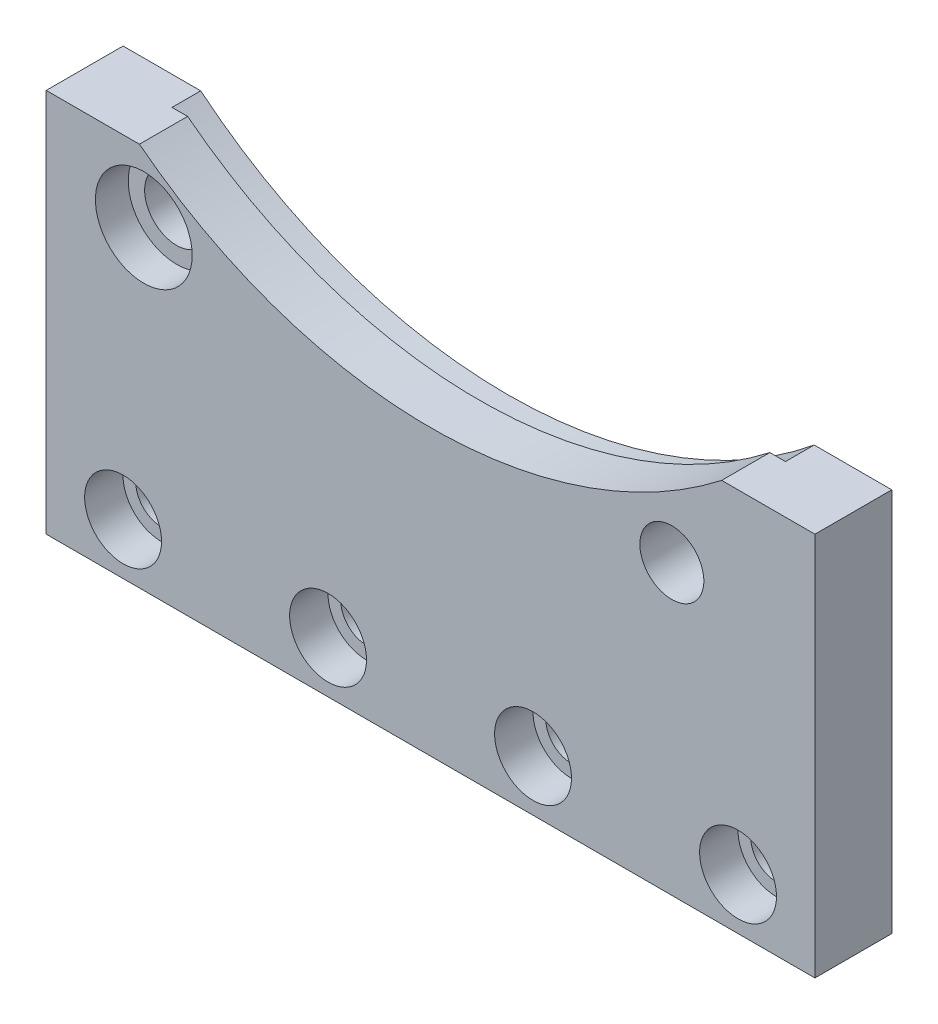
ISO-10303-21;
HEADER;
FILE_DESCRIPTION(('STEP AP214'),'2;1');
FILE_NAME('part.step','',(''),(''),'','','');
FILE_SCHEMA(('AUTOMOTIVE_DESIGN { 1 0 10303 214 1 1 1 1 }'));
ENDSEC;
DATA;
#1=APPLICATION_CONTEXT('core data for automotive mechanical design processes');
#2=APPLICATION_PROTOCOL_DEFINITION('international standard','automotive_design',2000,#1);
#3=PRODUCT_CONTEXT('',#1,'mechanical');
#4=PRODUCT('Part','Part','',(#3));
#5=PRODUCT_RELATED_PRODUCT_CATEGORY('part','',(#4));
#6=PRODUCT_DEFINITION_FORMATION('','',#4);
#7=PRODUCT_DEFINITION_CONTEXT('part definition',#1,'design');
#8=PRODUCT_DEFINITION('design','',#6,#7);
#9=PRODUCT_DEFINITION_SHAPE('','',#8);
#10=(LENGTH_UNIT() NAMED_UNIT(*) SI_UNIT(.MILLI.,.METRE.));
#11=(NAMED_UNIT(*) PLANE_ANGLE_UNIT() SI_UNIT($,.RADIAN.));
#12=(NAMED_UNIT(*) SI_UNIT($,.STERADIAN.) SOLID_ANGLE_UNIT());
#13=UNCERTAINTY_MEASURE_WITH_UNIT(LENGTH_MEASURE(1.E-05),#10,'distance_accuracy_value','');
#14=(GEOMETRIC_REPRESENTATION_CONTEXT(3) GLOBAL_UNCERTAINTY_ASSIGNED_CONTEXT((#13)) GLOBAL_UNIT_ASSIGNED_CONTEXT((#10,
#11,#12)) REPRESENTATION_CONTEXT('',''));
#15=CARTESIAN_POINT('',(0.,0.,0.));
#16=DIRECTION('',(0.,0.,1.));
#17=DIRECTION('',(1.,0.,0.));
#18=AXIS2_PLACEMENT_3D('',#15,#16,#17);
#19=CARTESIAN_POINT('',(-35.5346,38.9636,9.525));
#20=DIRECTION('',(0.,0.,-1.));
#21=DIRECTION('',(-1.,0.,0.));
#22=AXIS2_PLACEMENT_3D('',#19,#20,#21);
#23=CYLINDRICAL_SURFACE('',#22,3.9624);
#24=CARTESIAN_POINT('',(-35.5346,38.9636,0.));
#25=DIRECTION('',(0.,0.,1.));
#26=DIRECTION('',(1.,0.,0.));
#27=AXIS2_PLACEMENT_3D('',#24,#25,#26);
#28=CIRCLE('',#27,3.9624);
#29=CARTESIAN_POINT('',(-39.497,38.9636,0.));
#30=VERTEX_POINT('',#29);
#31=EDGE_CURVE('E288',#30,#30,#28,.T.);
#32=CARTESIAN_POINT('',(-35.5346,38.9636,5.461));
#33=DIRECTION('',(0.,0.,1.));
#34=DIRECTION('',(1.,0.,0.));
#35=AXIS2_PLACEMENT_3D('',#32,#33,#34);
#36=CIRCLE('',#35,3.9624);
#37=CARTESIAN_POINT('',(-39.497,38.9636,5.461));
#38=VERTEX_POINT('',#37);
#39=EDGE_CURVE('E37',#38,#38,#36,.T.);
#40=CARTESIAN_POINT('',(-39.497,38.9636,0.));
#41=CARTESIAN_POINT('',(-39.497,38.9636,0.0568854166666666));
#42=CARTESIAN_POINT('',(-39.497,38.9636,0.113770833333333));
#43=CARTESIAN_POINT('',(-39.497,38.9636,0.227541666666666));
#44=CARTESIAN_POINT('',(-39.497,38.9636,0.284427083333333));
#45=CARTESIAN_POINT('',(-39.497,38.9636,0.398197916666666));
#46=CARTESIAN_POINT('',(-39.497,38.9636,0.455083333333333));
#47=CARTESIAN_POINT('',(-39.497,38.9636,0.568854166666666));
#48=CARTESIAN_POINT('',(-39.497,38.9636,0.625739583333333));
#49=CARTESIAN_POINT('',(-39.497,38.9636,0.739510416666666));
#50=CARTESIAN_POINT('',(-39.497,38.9636,0.796395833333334));
#51=CARTESIAN_POINT('',(-39.497,38.9636,0.910166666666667));
#52=CARTESIAN_POINT('',(-39.497,38.9636,0.967052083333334));
#53=CARTESIAN_POINT('',(-39.497,38.9636,1.08082291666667));
#54=CARTESIAN_POINT('',(-39.497,38.9636,1.13770833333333));
#55=CARTESIAN_POINT('',(-39.497,38.9636,1.25147916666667));
#56=CARTESIAN_POINT('',(-39.497,38.9636,1.30836458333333));
#57=CARTESIAN_POINT('',(-39.497,38.9636,1.42213541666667));
#58=CARTESIAN_POINT('',(-39.497,38.9636,1.47902083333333));
#59=CARTESIAN_POINT('',(-39.497,38.9636,1.59279166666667));
#60=CARTESIAN_POINT('',(-39.497,38.9636,1.64967708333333));
#61=CARTESIAN_POINT('',(-39.497,38.9636,1.76344791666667));
#62=CARTESIAN_POINT('',(-39.497,38.9636,1.82033333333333));
#63=CARTESIAN_POINT('',(-39.497,38.9636,1.93410416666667));
#64=CARTESIAN_POINT('',(-39.497,38.9636,1.99098958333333));
#65=CARTESIAN_POINT('',(-39.497,38.9636,2.10476041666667));
#66=CARTESIAN_POINT('',(-39.497,38.9636,2.16164583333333));
#67=CARTESIAN_POINT('',(-39.497,38.9636,2.27541666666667));
#68=CARTESIAN_POINT('',(-39.497,38.9636,2.33230208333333));
#69=CARTESIAN_POINT('',(-39.497,38.9636,2.44607291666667));
#70=CARTESIAN_POINT('',(-39.497,38.9636,2.50295833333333));
#71=CARTESIAN_POINT('',(-39.497,38.9636,2.61672916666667));
#72=CARTESIAN_POINT('',(-39.497,38.9636,2.67361458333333));
#73=CARTESIAN_POINT('',(-39.497,38.9636,2.78738541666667));
#74=CARTESIAN_POINT('',(-39.497,38.9636,2.84427083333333));
#75=CARTESIAN_POINT('',(-39.497,38.9636,2.95804166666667));
#76=CARTESIAN_POINT('',(-39.497,38.9636,3.01492708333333));
#77=CARTESIAN_POINT('',(-39.497,38.9636,3.12869791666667));
#78=CARTESIAN_POINT('',(-39.497,38.9636,3.18558333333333));
#79=CARTESIAN_POINT('',(-39.497,38.9636,3.29935416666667));
#80=CARTESIAN_POINT('',(-39.497,38.9636,3.35623958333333));
#81=CARTESIAN_POINT('',(-39.497,38.9636,3.47001041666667));
#82=CARTESIAN_POINT('',(-39.497,38.9636,3.52689583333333));
#83=CARTESIAN_POINT('',(-39.497,38.9636,3.64066666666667));
#84=CARTESIAN_POINT('',(-39.497,38.9636,3.69755208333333));
#85=CARTESIAN_POINT('',(-39.497,38.9636,3.81132291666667));
#86=CARTESIAN_POINT('',(-39.497,38.9636,3.86820833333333));
#87=CARTESIAN_POINT('',(-39.497,38.9636,3.98197916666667));
#88=CARTESIAN_POINT('',(-39.497,38.9636,4.03886458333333));
#89=CARTESIAN_POINT('',(-39.497,38.9636,4.15263541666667));
#90=CARTESIAN_POINT('',(-39.497,38.9636,4.20952083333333));
#91=CARTESIAN_POINT('',(-39.497,38.9636,4.32329166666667));
#92=CARTESIAN_POINT('',(-39.497,38.9636,4.38017708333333));
#93=CARTESIAN_POINT('',(-39.497,38.9636,4.49394791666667));
#94=CARTESIAN_POINT('',(-39.497,38.9636,4.55083333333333));
#95=CARTESIAN_POINT('',(-39.497,38.9636,4.66460416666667));
#96=CARTESIAN_POINT('',(-39.497,38.9636,4.72148958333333));
#97=CARTESIAN_POINT('',(-39.497,38.9636,4.83526041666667));
#98=CARTESIAN_POINT('',(-39.497,38.9636,4.89214583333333));
#99=CARTESIAN_POINT('',(-39.497,38.9636,5.00591666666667));
#100=CARTESIAN_POINT('',(-39.497,38.9636,5.06280208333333));
#101=CARTESIAN_POINT('',(-39.497,38.9636,5.17657291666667));
#102=CARTESIAN_POINT('',(-39.497,38.9636,5.23345833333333));
#103=CARTESIAN_POINT('',(-39.497,38.9636,5.34722916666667));
#104=CARTESIAN_POINT('',(-39.497,38.9636,5.40411458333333));
#105=CARTESIAN_POINT('',(-39.497,38.9636,5.461));
#106=B_SPLINE_CURVE_WITH_KNOTS('',3,(#40,#41,#42,#43,#44,#45,#46,#47,#48,#49,#50,#51,#52,#53,
#54,#55,#56,#57,#58,#59,#60,#61,#62,#63,#64,#65,#66,#67,#68,#69,#70,#71,#72,#73,#74,#75,#76,#77,
#78,#79,#80,#81,#82,#83,#84,#85,#86,#87,#88,#89,#90,#91,#92,#93,#94,#95,#96,#97,#98,#99,#100,
#101,#102,#103,#104,#105),.UNSPECIFIED.,.F.,.F.,(4,2,2,2,2,2,2,2,2,2,2,2,2,2,2,2,2,2,2,2,2,2,2,
2,2,2,2,2,2,2,2,2,4),(0.,0.17065625,0.3413125,0.511968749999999,0.682624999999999,
0.853281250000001,1.0239375,1.19459375,1.36525,1.53590625,1.7065625,1.87721875,2.047875,
2.21853125,2.3891875,2.55984375,2.7305,2.90115625,3.0718125,3.24246875,3.413125,3.58378125,
3.7544375,3.92509375,4.09575,4.26640625,4.4370625,4.60771875,4.778375,4.94903125,5.1196875,
5.29034375,5.461),.UNSPECIFIED.);
#107=EDGE_CURVE('BSEAM33',#30,#38,#106,.T.);
#108=ORIENTED_EDGE('',*,*,#31,.F.);
#109=ORIENTED_EDGE('',*,*,#39,.T.);
#110=ORIENTED_EDGE('',*,*,#107,.T.);
#111=ORIENTED_EDGE('',*,*,#107,.F.);
#112=EDGE_LOOP('',(#108,#110,#109,#111));
#113=FACE_BOUND('',#112,.T.);
#114=ADVANCED_FACE('F33',(#113),#23,.F.);
#115=CARTESIAN_POINT('',(0.,0.,0.));
#116=DIRECTION('',(0.,0.,1.));
#117=DIRECTION('',(1.,0.,0.));
#118=AXIS2_PLACEMENT_3D('',#115,#116,#117);
#119=PLANE('',#118);
#120=CARTESIAN_POINT('',(29.8958,35.7124,0.));
#121=DIRECTION('',(0.,0.,1.));
#122=DIRECTION('',(1.,0.,0.));
#123=AXIS2_PLACEMENT_3D('',#120,#121,#122);
#124=CIRCLE('',#123,3.9624);
#125=CARTESIAN_POINT('',(25.9334,35.7124,0.));
#126=VERTEX_POINT('',#125);
#127=EDGE_CURVE('E291',#126,#126,#124,.T.);
#128=ORIENTED_EDGE('',*,*,#127,.T.);
#129=EDGE_LOOP('',(#128));
#130=FACE_BOUND('',#129,.T.);
#131=CARTESIAN_POINT('',(12.7,6.35,0.));
#132=DIRECTION('',(0.,0.,1.));
#133=DIRECTION('',(1.,0.,0.));
#134=AXIS2_PLACEMENT_3D('',#131,#132,#133);
#135=CIRCLE('',#134,3.175);
#136=CARTESIAN_POINT('',(9.525,6.35,0.));
#137=VERTEX_POINT('',#136);
#138=EDGE_CURVE('E258',#137,#137,#135,.T.);
#139=ORIENTED_EDGE('',*,*,#138,.T.);
#140=EDGE_LOOP('',(#139));
#141=FACE_BOUND('',#140,.T.);
#142=CARTESIAN_POINT('',(-38.1,6.35,0.));
#143=DIRECTION('',(0.,0.,1.));
#144=DIRECTION('',(1.,0.,0.));
#145=AXIS2_PLACEMENT_3D('',#142,#143,#144);
#146=CIRCLE('',#145,3.175);
#147=CARTESIAN_POINT('',(-41.275,6.35,0.));
#148=VERTEX_POINT('',#147);
#149=EDGE_CURVE('E251',#148,#148,#146,.T.);
#150=ORIENTED_EDGE('',*,*,#149,.T.);
#151=EDGE_LOOP('',(#150));
#152=FACE_BOUND('',#151,.T.);
#153=CARTESIAN_POINT('',(-12.7,6.35,0.));
#154=DIRECTION('',(0.,0.,1.));
#155=DIRECTION('',(1.,0.,0.));
#156=AXIS2_PLACEMENT_3D('',#153,#154,#155);
#157=CIRCLE('',#156,3.175);
#158=CARTESIAN_POINT('',(-15.875,6.35,0.));
#159=VERTEX_POINT('',#158);
#160=EDGE_CURVE('E253',#159,#159,#157,.T.);
#161=ORIENTED_EDGE('',*,*,#160,.T.);
#162=EDGE_LOOP('',(#161));
#163=FACE_BOUND('',#162,.T.);
#164=CARTESIAN_POINT('',(38.1,6.35,0.));
#165=DIRECTION('',(0.,0.,1.));
#166=DIRECTION('',(1.,0.,0.));
#167=AXIS2_PLACEMENT_3D('',#164,#165,#166);
#168=CIRCLE('',#167,3.175);
#169=CARTESIAN_POINT('',(34.925,6.35,0.));
#170=VERTEX_POINT('',#169);
#171=EDGE_CURVE('E295',#170,#170,#168,.T.);
#172=ORIENTED_EDGE('',*,*,#171,.T.);
#173=EDGE_LOOP('',(#172));
#174=FACE_BOUND('',#173,.T.);
#175=ORIENTED_EDGE('',*,*,#31,.T.);
#176=EDGE_LOOP('',(#175));
#177=FACE_BOUND('',#176,.T.);
#178=CARTESIAN_POINT('',(0.,93.98,0.));
#179=DIRECTION('',(0.,0.,1.));
#180=DIRECTION('',(1.,0.,0.));
#181=AXIS2_PLACEMENT_3D('',#178,#179,#180);
#182=CIRCLE('',#181,59.944);
#183=CARTESIAN_POINT('',(-38.0065403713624,47.625,0.));
#184=VERTEX_POINT('',#183);
#185=CARTESIAN_POINT('',(38.0065403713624,47.625,0.));
#186=VERTEX_POINT('',#185);
#187=EDGE_CURVE('E99',#184,#186,#182,.T.);
#188=ORIENTED_EDGE('',*,*,#187,.T.);
#189=DIRECTION('',(-1.,0.,0.));
#190=VECTOR('',#189,1.);
#191=CARTESIAN_POINT('',(47.625,47.625,0.));
#192=LINE('',#191,#190);
#193=CARTESIAN_POINT('',(47.625,47.625,0.));
#194=VERTEX_POINT('',#193);
#195=EDGE_CURVE('E123',#194,#186,#192,.T.);
#196=ORIENTED_EDGE('',*,*,#195,.F.);
#197=DIRECTION('',(0.,1.,0.));
#198=VECTOR('',#197,1.);
#199=CARTESIAN_POINT('',(47.625,0.,0.));
#200=LINE('',#199,#198);
#201=CARTESIAN_POINT('',(47.625,0.,0.));
#202=VERTEX_POINT('',#201);
#203=EDGE_CURVE('E124',#202,#194,#200,.T.);
#204=ORIENTED_EDGE('',*,*,#203,.F.);
#205=DIRECTION('',(1.,0.,0.));
#206=VECTOR('',#205,1.);
#207=CARTESIAN_POINT('',(0.,0.,0.));
#208=LINE('',#207,#206);
#209=CARTESIAN_POINT('',(-47.625,0.,0.));
#210=VERTEX_POINT('',#209);
#211=EDGE_CURVE('E127',#210,#202,#208,.T.);
#212=ORIENTED_EDGE('',*,*,#211,.F.);
#213=DIRECTION('',(0.,-1.,0.));
#214=VECTOR('',#213,1.);
#215=CARTESIAN_POINT('',(-47.625,47.625,0.));
#216=LINE('',#215,#214);
#217=CARTESIAN_POINT('',(-47.625,47.625,0.));
#218=VERTEX_POINT('',#217);
#219=EDGE_CURVE('E122',#218,#210,#216,.T.);
#220=ORIENTED_EDGE('',*,*,#219,.F.);
#221=EDGE_CURVE('E114',#184,#218,#192,.T.);
#222=ORIENTED_EDGE('',*,*,#221,.F.);
#223=EDGE_LOOP('',(#188,#196,#204,#212,#220,#222));
#224=FACE_BOUND('',#223,.T.);
#225=ADVANCED_FACE('F120',(#130,#141,#152,#163,#174,#177,#224),#119,.F.);
#226=CARTESIAN_POINT('',(47.625,47.625,9.525));
#227=DIRECTION('',(0.,-1.,0.));
#228=DIRECTION('',(1.,0.,0.));
#229=AXIS2_PLACEMENT_3D('',#226,#227,#228);
#230=PLANE('',#229);
#231=DIRECTION('',(0.,0.,-1.));
#232=VECTOR('',#231,1.);
#233=CARTESIAN_POINT('',(-38.0065403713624,47.625,3.556));
#234=LINE('',#233,#232);
#235=CARTESIAN_POINT('',(-38.0065403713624,47.625,3.556));
#236=VERTEX_POINT('',#235);
#237=EDGE_CURVE('E103',#184,#236,#234,.F.);
#238=ORIENTED_EDGE('',*,*,#237,.F.);
#239=ORIENTED_EDGE('',*,*,#221,.T.);
#240=DIRECTION('',(0.,0.,-1.));
#241=VECTOR('',#240,1.);
#242=CARTESIAN_POINT('',(-47.625,47.625,9.525));
#243=LINE('',#242,#241);
#244=CARTESIAN_POINT('',(-47.625,47.625,9.525));
#245=VERTEX_POINT('',#244);
#246=EDGE_CURVE('E131',#245,#218,#243,.T.);
#247=ORIENTED_EDGE('',*,*,#246,.F.);
#248=DIRECTION('',(-1.,0.,0.));
#249=VECTOR('',#248,1.);
#250=CARTESIAN_POINT('',(47.625,47.625,9.525));
#251=LINE('',#250,#249);
#252=CARTESIAN_POINT('',(-36.0736452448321,47.625,9.525));
#253=VERTEX_POINT('',#252);
#254=EDGE_CURVE('E246',#253,#245,#251,.T.);
#255=ORIENTED_EDGE('',*,*,#254,.F.);
#256=DIRECTION('',(0.,0.,-1.));
#257=VECTOR('',#256,1.);
#258=CARTESIAN_POINT('',(-36.0736452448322,47.625,14.605));
#259=LINE('',#258,#257);
#260=CARTESIAN_POINT('',(-36.0736452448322,47.625,3.556));
#261=VERTEX_POINT('',#260);
#262=EDGE_CURVE('E145',#261,#253,#259,.F.);
#263=ORIENTED_EDGE('',*,*,#262,.F.);
#264=DIRECTION('',(-1.,0.,0.));
#265=VECTOR('',#264,1.);
#266=CARTESIAN_POINT('',(47.625,47.625,3.556));
#267=LINE('',#266,#265);
#268=EDGE_CURVE('E49',#261,#236,#267,.T.);
#269=ORIENTED_EDGE('',*,*,#268,.T.);
#270=EDGE_LOOP('',(#238,#239,#247,#255,#263,#269));
#271=FACE_BOUND('',#270,.T.);
#272=ADVANCED_FACE('F112',(#271),#230,.F.);
#273=DIRECTION('',(0.,0.,-1.));
#274=VECTOR('',#273,1.);
#275=CARTESIAN_POINT('',(38.0065403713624,47.625,3.556));
#276=LINE('',#275,#274);
#277=CARTESIAN_POINT('',(38.0065403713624,47.625,3.556));
#278=VERTEX_POINT('',#277);
#279=EDGE_CURVE('E11',#278,#186,#276,.T.);
#280=ORIENTED_EDGE('',*,*,#279,.F.);
#281=DIRECTION('',(-1.,0.,0.));
#282=VECTOR('',#281,1.);
#283=CARTESIAN_POINT('',(47.625,47.625,3.556));
#284=LINE('',#283,#282);
#285=CARTESIAN_POINT('',(36.0736452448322,47.625,3.556));
#286=VERTEX_POINT('',#285);
#287=EDGE_CURVE('E176',#278,#286,#284,.T.);
#288=ORIENTED_EDGE('',*,*,#287,.T.);
#289=DIRECTION('',(0.,0.,-1.));
#290=VECTOR('',#289,1.);
#291=CARTESIAN_POINT('',(36.0736452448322,47.625,14.605));
#292=LINE('',#291,#290);
#293=CARTESIAN_POINT('',(36.0736452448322,47.625,9.525));
#294=VERTEX_POINT('',#293);
#295=EDGE_CURVE('E143',#294,#286,#292,.T.);
#296=ORIENTED_EDGE('',*,*,#295,.F.);
#297=CARTESIAN_POINT('',(47.625,47.625,9.525));
#298=VERTEX_POINT('',#297);
#299=EDGE_CURVE('E134',#298,#294,#251,.T.);
#300=ORIENTED_EDGE('',*,*,#299,.F.);
#301=DIRECTION('',(0.,0.,-1.));
#302=VECTOR('',#301,1.);
#303=CARTESIAN_POINT('',(47.625,47.625,9.525));
#304=LINE('',#303,#302);
#305=EDGE_CURVE('E133',#298,#194,#304,.T.);
#306=ORIENTED_EDGE('',*,*,#305,.T.);
#307=ORIENTED_EDGE('',*,*,#195,.T.);
#308=EDGE_LOOP('',(#280,#288,#296,#300,#306,#307));
#309=FACE_BOUND('',#308,.T.);
#310=ADVANCED_FACE('F178',(#309),#230,.F.);
#311=CARTESIAN_POINT('',(0.,0.,9.525));
#312=DIRECTION('',(0.,0.,1.));
#313=DIRECTION('',(1.,0.,0.));
#314=AXIS2_PLACEMENT_3D('',#311,#312,#313);
#315=PLANE('',#314);
#316=CARTESIAN_POINT('',(-35.5346,38.9636,9.525));
#317=DIRECTION('',(0.,0.,1.));
#318=DIRECTION('',(1.,0.,0.));
#319=AXIS2_PLACEMENT_3D('',#316,#317,#318);
#320=CIRCLE('',#319,5.9944);
#321=CARTESIAN_POINT('',(-29.5402,38.9636,9.525));
#322=VERTEX_POINT('',#321);
#323=EDGE_CURVE('E453',#322,#322,#320,.T.);
#324=ORIENTED_EDGE('',*,*,#323,.F.);
#325=EDGE_LOOP('',(#324));
#326=FACE_BOUND('',#325,.T.);
#327=CARTESIAN_POINT('',(12.7,6.35,9.525));
#328=DIRECTION('',(0.,0.,1.));
#329=DIRECTION('',(1.,0.,0.));
#330=AXIS2_PLACEMENT_3D('',#327,#328,#329);
#331=CIRCLE('',#330,4.7625);
#332=CARTESIAN_POINT('',(17.4625,6.35,9.525));
#333=VERTEX_POINT('',#332);
#334=EDGE_CURVE('E164',#333,#333,#331,.F.);
#335=ORIENTED_EDGE('',*,*,#334,.T.);
#336=EDGE_LOOP('',(#335));
#337=FACE_BOUND('',#336,.T.);
#338=CARTESIAN_POINT('',(-38.1,6.35,9.525));
#339=DIRECTION('',(0.,0.,1.));
#340=DIRECTION('',(1.,0.,0.));
#341=AXIS2_PLACEMENT_3D('',#338,#339,#340);
#342=CIRCLE('',#341,4.7625);
#343=CARTESIAN_POINT('',(-33.3375,6.35,9.525));
#344=VERTEX_POINT('',#343);
#345=EDGE_CURVE('E150',#344,#344,#342,.F.);
#346=ORIENTED_EDGE('',*,*,#345,.T.);
#347=EDGE_LOOP('',(#346));
#348=FACE_BOUND('',#347,.T.);
#349=CARTESIAN_POINT('',(29.8958,35.7124,9.525));
#350=DIRECTION('',(0.,0.,1.));
#351=DIRECTION('',(1.,0.,0.));
#352=AXIS2_PLACEMENT_3D('',#349,#350,#351);
#353=CIRCLE('',#352,3.9624);
#354=CARTESIAN_POINT('',(25.9334,35.7124,9.525));
#355=VERTEX_POINT('',#354);
#356=EDGE_CURVE('E292',#355,#355,#353,.T.);
#357=ORIENTED_EDGE('',*,*,#356,.F.);
#358=EDGE_LOOP('',(#357));
#359=FACE_BOUND('',#358,.T.);
#360=ORIENTED_EDGE('',*,*,#299,.T.);
#361=CARTESIAN_POINT('',(0.,93.98,9.525));
#362=DIRECTION('',(0.,0.,1.));
#363=DIRECTION('',(1.,0.,0.));
#364=AXIS2_PLACEMENT_3D('',#361,#362,#363);
#365=CIRCLE('',#364,58.7375);
#366=EDGE_CURVE('E57',#294,#253,#365,.F.);
#367=ORIENTED_EDGE('',*,*,#366,.T.);
#368=ORIENTED_EDGE('',*,*,#254,.T.);
#369=DIRECTION('',(0.,-1.,0.));
#370=VECTOR('',#369,1.);
#371=CARTESIAN_POINT('',(-47.625,47.625,9.525));
#372=LINE('',#371,#370);
#373=CARTESIAN_POINT('',(-47.625,0.,9.525));
#374=VERTEX_POINT('',#373);
#375=EDGE_CURVE('E126',#245,#374,#372,.T.);
#376=ORIENTED_EDGE('',*,*,#375,.T.);
#377=DIRECTION('',(1.,0.,0.));
#378=VECTOR('',#377,1.);
#379=CARTESIAN_POINT('',(-47.625,0.,9.525));
#380=LINE('',#379,#378);
#381=CARTESIAN_POINT('',(47.625,0.,9.525));
#382=VERTEX_POINT('',#381);
#383=EDGE_CURVE('E263',#374,#382,#380,.T.);
#384=ORIENTED_EDGE('',*,*,#383,.T.);
#385=DIRECTION('',(0.,1.,0.));
#386=VECTOR('',#385,1.);
#387=CARTESIAN_POINT('',(47.625,0.,9.525));
#388=LINE('',#387,#386);
#389=EDGE_CURVE('E244',#382,#298,#388,.T.);
#390=ORIENTED_EDGE('',*,*,#389,.T.);
#391=EDGE_LOOP('',(#360,#367,#368,#376,#384,#390));
#392=FACE_BOUND('',#391,.T.);
#393=CARTESIAN_POINT('',(-12.7,6.35,9.525));
#394=DIRECTION('',(0.,0.,1.));
#395=DIRECTION('',(1.,0.,0.));
#396=AXIS2_PLACEMENT_3D('',#393,#394,#395);
#397=CIRCLE('',#396,4.7625);
#398=CARTESIAN_POINT('',(-7.9375,6.35,9.525));
#399=VERTEX_POINT('',#398);
#400=EDGE_CURVE('E157',#399,#399,#397,.F.);
#401=ORIENTED_EDGE('',*,*,#400,.T.);
#402=EDGE_LOOP('',(#401));
#403=FACE_BOUND('',#402,.T.);
#404=CARTESIAN_POINT('',(38.1,6.35,9.525));
#405=DIRECTION('',(0.,0.,1.));
#406=DIRECTION('',(1.,0.,0.));
#407=AXIS2_PLACEMENT_3D('',#404,#405,#406);
#408=CIRCLE('',#407,4.7625);
#409=CARTESIAN_POINT('',(42.8625,6.35,9.525));
#410=VERTEX_POINT('',#409);
#411=EDGE_CURVE('E171',#410,#410,#408,.F.);
#412=ORIENTED_EDGE('',*,*,#411,.T.);
#413=EDGE_LOOP('',(#412));
#414=FACE_BOUND('',#413,.T.);
#415=ADVANCED_FACE('F212',(#326,#337,#348,#359,#392,#403,#414),#315,.T.);
#416=CARTESIAN_POINT('',(38.1,6.35,9.525));
#417=DIRECTION('',(0.,0.,-1.));
#418=DIRECTION('',(-1.,0.,0.));
#419=AXIS2_PLACEMENT_3D('',#416,#417,#418);
#420=CYLINDRICAL_SURFACE('',#419,3.175);
#421=CARTESIAN_POINT('',(38.1,6.35,4.7752));
#422=DIRECTION('',(0.,0.,1.));
#423=DIRECTION('',(1.,0.,0.));
#424=AXIS2_PLACEMENT_3D('',#421,#422,#423);
#425=CIRCLE('',#424,3.175);
#426=CARTESIAN_POINT('',(34.925,6.35,4.7752));
#427=VERTEX_POINT('',#426);
#428=EDGE_CURVE('E168',#427,#427,#425,.T.);
#429=CARTESIAN_POINT('',(34.925,6.35,0.));
#430=CARTESIAN_POINT('',(34.925,6.35,0.0497416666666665));
#431=CARTESIAN_POINT('',(34.925,6.35,0.0994833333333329));
#432=CARTESIAN_POINT('',(34.925,6.35,0.198966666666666));
#433=CARTESIAN_POINT('',(34.925,6.35,0.248708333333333));
#434=CARTESIAN_POINT('',(34.925,6.35,0.348191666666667));
#435=CARTESIAN_POINT('',(34.925,6.35,0.397933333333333));
#436=CARTESIAN_POINT('',(34.925,6.35,0.497416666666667));
#437=CARTESIAN_POINT('',(34.925,6.35,0.547158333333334));
#438=CARTESIAN_POINT('',(34.925,6.35,0.646641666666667));
#439=CARTESIAN_POINT('',(34.925,6.35,0.696383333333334));
#440=CARTESIAN_POINT('',(34.925,6.35,0.795866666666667));
#441=CARTESIAN_POINT('',(34.925,6.35,0.845608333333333));
#442=CARTESIAN_POINT('',(34.925,6.35,0.945091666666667));
#443=CARTESIAN_POINT('',(34.925,6.35,0.994833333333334));
#444=CARTESIAN_POINT('',(34.925,6.35,1.09431666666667));
#445=CARTESIAN_POINT('',(34.925,6.35,1.14405833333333));
#446=CARTESIAN_POINT('',(34.925,6.35,1.24354166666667));
#447=CARTESIAN_POINT('',(34.925,6.35,1.29328333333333));
#448=CARTESIAN_POINT('',(34.925,6.35,1.39276666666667));
#449=CARTESIAN_POINT('',(34.925,6.35,1.44250833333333));
#450=CARTESIAN_POINT('',(34.925,6.35,1.54199166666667));
#451=CARTESIAN_POINT('',(34.925,6.35,1.59173333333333));
#452=CARTESIAN_POINT('',(34.925,6.35,1.69121666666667));
#453=CARTESIAN_POINT('',(34.925,6.35,1.74095833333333));
#454=CARTESIAN_POINT('',(34.925,6.35,1.84044166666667));
#455=CARTESIAN_POINT('',(34.925,6.35,1.89018333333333));
#456=CARTESIAN_POINT('',(34.925,6.35,1.98966666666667));
#457=CARTESIAN_POINT('',(34.925,6.35,2.03940833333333));
#458=CARTESIAN_POINT('',(34.925,6.35,2.13889166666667));
#459=CARTESIAN_POINT('',(34.925,6.35,2.18863333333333));
#460=CARTESIAN_POINT('',(34.925,6.35,2.28811666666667));
#461=CARTESIAN_POINT('',(34.925,6.35,2.33785833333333));
#462=CARTESIAN_POINT('',(34.925,6.35,2.43734166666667));
#463=CARTESIAN_POINT('',(34.925,6.35,2.48708333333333));
#464=CARTESIAN_POINT('',(34.925,6.35,2.58656666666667));
#465=CARTESIAN_POINT('',(34.925,6.35,2.63630833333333));
#466=CARTESIAN_POINT('',(34.925,6.35,2.73579166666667));
#467=CARTESIAN_POINT('',(34.925,6.35,2.78553333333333));
#468=CARTESIAN_POINT('',(34.925,6.35,2.88501666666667));
#469=CARTESIAN_POINT('',(34.925,6.35,2.93475833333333));
#470=CARTESIAN_POINT('',(34.925,6.35,3.03424166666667));
#471=CARTESIAN_POINT('',(34.925,6.35,3.08398333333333));
#472=CARTESIAN_POINT('',(34.925,6.35,3.18346666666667));
#473=CARTESIAN_POINT('',(34.925,6.35,3.23320833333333));
#474=CARTESIAN_POINT('',(34.925,6.35,3.33269166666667));
#475=CARTESIAN_POINT('',(34.925,6.35,3.38243333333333));
#476=CARTESIAN_POINT('',(34.925,6.35,3.48191666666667));
#477=CARTESIAN_POINT('',(34.925,6.35,3.53165833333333));
#478=CARTESIAN_POINT('',(34.925,6.35,3.63114166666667));
#479=CARTESIAN_POINT('',(34.925,6.35,3.68088333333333));
#480=CARTESIAN_POINT('',(34.925,6.35,3.78036666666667));
#481=CARTESIAN_POINT('',(34.925,6.35,3.83010833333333));
#482=CARTESIAN_POINT('',(34.925,6.35,3.92959166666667));
#483=CARTESIAN_POINT('',(34.925,6.35,3.97933333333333));
#484=CARTESIAN_POINT('',(34.925,6.35,4.07881666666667));
#485=CARTESIAN_POINT('',(34.925,6.35,4.12855833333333));
#486=CARTESIAN_POINT('',(34.925,6.35,4.22804166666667));
#487=CARTESIAN_POINT('',(34.925,6.35,4.27778333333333));
#488=CARTESIAN_POINT('',(34.925,6.35,4.37726666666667));
#489=CARTESIAN_POINT('',(34.925,6.35,4.42700833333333));
#490=CARTESIAN_POINT('',(34.925,6.35,4.52649166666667));
#491=CARTESIAN_POINT('',(34.925,6.35,4.57623333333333));
#492=CARTESIAN_POINT('',(34.925,6.35,4.67571666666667));
#493=CARTESIAN_POINT('',(34.925,6.35,4.72545833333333));
#494=CARTESIAN_POINT('',(34.925,6.35,4.7752));
#495=B_SPLINE_CURVE_WITH_KNOTS('',3,(#429,#430,#431,#432,#433,#434,#435,#436,#437,#438,#439,
#440,#441,#442,#443,#444,#445,#446,#447,#448,#449,#450,#451,#452,#453,#454,#455,#456,#457,#458,
#459,#460,#461,#462,#463,#464,#465,#466,#467,#468,#469,#470,#471,#472,#473,#474,#475,#476,#477,
#478,#479,#480,#481,#482,#483,#484,#485,#486,#487,#488,#489,#490,#491,#492,#493,#494),
.UNSPECIFIED.,.F.,.F.,(4,2,2,2,2,2,2,2,2,2,2,2,2,2,2,2,2,2,2,2,2,2,2,2,2,2,2,2,2,2,2,2,4),(0.,
0.149224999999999,0.29845,0.447675,0.596900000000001,0.746125,0.89535,1.044575,1.1938,1.343025,
1.49225,1.641475,1.7907,1.939925,2.08915,2.238375,2.3876,2.536825,2.68605,2.835275,2.9845,
3.133725,3.28295,3.432175,3.5814,3.730625,3.87985,4.029075,4.1783,4.327525,4.47675,4.625975,
4.7752),.UNSPECIFIED.);
#496=EDGE_CURVE('BSEAM208',#170,#427,#495,.T.);
#497=ORIENTED_EDGE('',*,*,#171,.F.);
#498=ORIENTED_EDGE('',*,*,#428,.T.);
#499=ORIENTED_EDGE('',*,*,#496,.T.);
#500=ORIENTED_EDGE('',*,*,#496,.F.);
#501=EDGE_LOOP('',(#497,#499,#498,#500));
#502=FACE_BOUND('',#501,.T.);
#503=ADVANCED_FACE('F208',(#502),#420,.F.);
#504=CARTESIAN_POINT('',(12.7,6.35,9.525));
#505=DIRECTION('',(0.,0.,-1.));
#506=DIRECTION('',(-1.,0.,0.));
#507=AXIS2_PLACEMENT_3D('',#504,#505,#506);
#508=CYLINDRICAL_SURFACE('',#507,3.175);
#509=CARTESIAN_POINT('',(12.7,6.35,4.7752));
#510=DIRECTION('',(0.,0.,1.));
#511=DIRECTION('',(1.,0.,0.));
#512=AXIS2_PLACEMENT_3D('',#509,#510,#511);
#513=CIRCLE('',#512,3.175);
#514=CARTESIAN_POINT('',(9.525,6.35,4.7752));
#515=VERTEX_POINT('',#514);
#516=EDGE_CURVE('E161',#515,#515,#513,.T.);
#517=CARTESIAN_POINT('',(9.525,6.35,0.));
#518=CARTESIAN_POINT('',(9.525,6.35,0.0497416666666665));
#519=CARTESIAN_POINT('',(9.525,6.35,0.0994833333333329));
#520=CARTESIAN_POINT('',(9.525,6.35,0.198966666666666));
#521=CARTESIAN_POINT('',(9.525,6.35,0.248708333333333));
#522=CARTESIAN_POINT('',(9.525,6.35,0.348191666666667));
#523=CARTESIAN_POINT('',(9.525,6.35,0.397933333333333));
#524=CARTESIAN_POINT('',(9.525,6.35,0.497416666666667));
#525=CARTESIAN_POINT('',(9.525,6.35,0.547158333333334));
#526=CARTESIAN_POINT('',(9.525,6.35,0.646641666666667));
#527=CARTESIAN_POINT('',(9.525,6.35,0.696383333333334));
#528=CARTESIAN_POINT('',(9.525,6.35,0.795866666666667));
#529=CARTESIAN_POINT('',(9.525,6.35,0.845608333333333));
#530=CARTESIAN_POINT('',(9.525,6.35,0.945091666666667));
#531=CARTESIAN_POINT('',(9.525,6.35,0.994833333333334));
#532=CARTESIAN_POINT('',(9.525,6.35,1.09431666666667));
#533=CARTESIAN_POINT('',(9.525,6.35,1.14405833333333));
#534=CARTESIAN_POINT('',(9.525,6.35,1.24354166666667));
#535=CARTESIAN_POINT('',(9.525,6.35,1.29328333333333));
#536=CARTESIAN_POINT('',(9.525,6.35,1.39276666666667));
#537=CARTESIAN_POINT('',(9.525,6.35,1.44250833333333));
#538=CARTESIAN_POINT('',(9.525,6.35,1.54199166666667));
#539=CARTESIAN_POINT('',(9.525,6.35,1.59173333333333));
#540=CARTESIAN_POINT('',(9.525,6.35,1.69121666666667));
#541=CARTESIAN_POINT('',(9.525,6.35,1.74095833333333));
#542=CARTESIAN_POINT('',(9.525,6.35,1.84044166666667));
#543=CARTESIAN_POINT('',(9.525,6.35,1.89018333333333));
#544=CARTESIAN_POINT('',(9.525,6.35,1.98966666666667));
#545=CARTESIAN_POINT('',(9.525,6.35,2.03940833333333));
#546=CARTESIAN_POINT('',(9.525,6.35,2.13889166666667));
#547=CARTESIAN_POINT('',(9.525,6.35,2.18863333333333));
#548=CARTESIAN_POINT('',(9.525,6.35,2.28811666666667));
#549=CARTESIAN_POINT('',(9.525,6.35,2.33785833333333));
#550=CARTESIAN_POINT('',(9.525,6.35,2.43734166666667));
#551=CARTESIAN_POINT('',(9.525,6.35,2.48708333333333));
#552=CARTESIAN_POINT('',(9.525,6.35,2.58656666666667));
#553=CARTESIAN_POINT('',(9.525,6.35,2.63630833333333));
#554=CARTESIAN_POINT('',(9.525,6.35,2.73579166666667));
#555=CARTESIAN_POINT('',(9.525,6.35,2.78553333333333));
#556=CARTESIAN_POINT('',(9.525,6.35,2.88501666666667));
#557=CARTESIAN_POINT('',(9.525,6.35,2.93475833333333));
#558=CARTESIAN_POINT('',(9.525,6.35,3.03424166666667));
#559=CARTESIAN_POINT('',(9.525,6.35,3.08398333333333));
#560=CARTESIAN_POINT('',(9.525,6.35,3.18346666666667));
#561=CARTESIAN_POINT('',(9.525,6.35,3.23320833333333));
#562=CARTESIAN_POINT('',(9.525,6.35,3.33269166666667));
#563=CARTESIAN_POINT('',(9.525,6.35,3.38243333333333));
#564=CARTESIAN_POINT('',(9.525,6.35,3.48191666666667));
#565=CARTESIAN_POINT('',(9.525,6.35,3.53165833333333));
#566=CARTESIAN_POINT('',(9.525,6.35,3.63114166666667));
#567=CARTESIAN_POINT('',(9.525,6.35,3.68088333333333));
#568=CARTESIAN_POINT('',(9.525,6.35,3.78036666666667));
#569=CARTESIAN_POINT('',(9.525,6.35,3.83010833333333));
#570=CARTESIAN_POINT('',(9.525,6.35,3.92959166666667));
#571=CARTESIAN_POINT('',(9.525,6.35,3.97933333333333));
#572=CARTESIAN_POINT('',(9.525,6.35,4.07881666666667));
#573=CARTESIAN_POINT('',(9.525,6.35,4.12855833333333));
#574=CARTESIAN_POINT('',(9.525,6.35,4.22804166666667));
#575=CARTESIAN_POINT('',(9.525,6.35,4.27778333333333));
#576=CARTESIAN_POINT('',(9.525,6.35,4.37726666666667));
#577=CARTESIAN_POINT('',(9.525,6.35,4.42700833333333));
#578=CARTESIAN_POINT('',(9.525,6.35,4.52649166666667));
#579=CARTESIAN_POINT('',(9.525,6.35,4.57623333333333));
#580=CARTESIAN_POINT('',(9.525,6.35,4.67571666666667));
#581=CARTESIAN_POINT('',(9.525,6.35,4.72545833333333));
#582=CARTESIAN_POINT('',(9.525,6.35,4.7752));
#583=B_SPLINE_CURVE_WITH_KNOTS('',3,(#517,#518,#519,#520,#521,#522,#523,#524,#525,#526,#527,
#528,#529,#530,#531,#532,#533,#534,#535,#536,#537,#538,#539,#540,#541,#542,#543,#544,#545,#546,
#547,#548,#549,#550,#551,#552,#553,#554,#555,#556,#557,#558,#559,#560,#561,#562,#563,#564,#565,
#566,#567,#568,#569,#570,#571,#572,#573,#574,#575,#576,#577,#578,#579,#580,#581,#582),
.UNSPECIFIED.,.F.,.F.,(4,2,2,2,2,2,2,2,2,2,2,2,2,2,2,2,2,2,2,2,2,2,2,2,2,2,2,2,2,2,2,2,4),(0.,
0.149224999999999,0.29845,0.447675,0.596900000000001,0.746125,0.89535,1.044575,1.1938,1.343025,
1.49225,1.641475,1.7907,1.939925,2.08915,2.238375,2.3876,2.536825,2.68605,2.835275,2.9845,
3.133725,3.28295,3.432175,3.5814,3.730625,3.87985,4.029075,4.1783,4.327525,4.47675,4.625975,
4.7752),.UNSPECIFIED.);
#584=EDGE_CURVE('BSEAM211',#137,#515,#583,.T.);
#585=ORIENTED_EDGE('',*,*,#138,.F.);
#586=ORIENTED_EDGE('',*,*,#516,.T.);
#587=ORIENTED_EDGE('',*,*,#584,.T.);
#588=ORIENTED_EDGE('',*,*,#584,.F.);
#589=EDGE_LOOP('',(#585,#587,#586,#588));
#590=FACE_BOUND('',#589,.T.);
#591=ADVANCED_FACE('F211',(#590),#508,.F.);
#592=CARTESIAN_POINT('',(-12.7,6.35,9.525));
#593=DIRECTION('',(0.,0.,-1.));
#594=DIRECTION('',(-1.,0.,0.));
#595=AXIS2_PLACEMENT_3D('',#592,#593,#594);
#596=CYLINDRICAL_SURFACE('',#595,3.175);
#597=CARTESIAN_POINT('',(-12.7,6.35,4.7752));
#598=DIRECTION('',(0.,0.,1.));
#599=DIRECTION('',(1.,0.,0.));
#600=AXIS2_PLACEMENT_3D('',#597,#598,#599);
#601=CIRCLE('',#600,3.175);
#602=CARTESIAN_POINT('',(-15.875,6.35,4.7752));
#603=VERTEX_POINT('',#602);
#604=EDGE_CURVE('E154',#603,#603,#601,.T.);
#605=CARTESIAN_POINT('',(-15.875,6.35,0.));
#606=CARTESIAN_POINT('',(-15.875,6.35,0.0497416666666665));
#607=CARTESIAN_POINT('',(-15.875,6.35,0.0994833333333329));
#608=CARTESIAN_POINT('',(-15.875,6.35,0.198966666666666));
#609=CARTESIAN_POINT('',(-15.875,6.35,0.248708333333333));
#610=CARTESIAN_POINT('',(-15.875,6.35,0.348191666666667));
#611=CARTESIAN_POINT('',(-15.875,6.35,0.397933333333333));
#612=CARTESIAN_POINT('',(-15.875,6.35,0.497416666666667));
#613=CARTESIAN_POINT('',(-15.875,6.35,0.547158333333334));
#614=CARTESIAN_POINT('',(-15.875,6.35,0.646641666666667));
#615=CARTESIAN_POINT('',(-15.875,6.35,0.696383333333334));
#616=CARTESIAN_POINT('',(-15.875,6.35,0.795866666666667));
#617=CARTESIAN_POINT('',(-15.875,6.35,0.845608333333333));
#618=CARTESIAN_POINT('',(-15.875,6.35,0.945091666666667));
#619=CARTESIAN_POINT('',(-15.875,6.35,0.994833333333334));
#620=CARTESIAN_POINT('',(-15.875,6.35,1.09431666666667));
#621=CARTESIAN_POINT('',(-15.875,6.35,1.14405833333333));
#622=CARTESIAN_POINT('',(-15.875,6.35,1.24354166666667));
#623=CARTESIAN_POINT('',(-15.875,6.35,1.29328333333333));
#624=CARTESIAN_POINT('',(-15.875,6.35,1.39276666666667));
#625=CARTESIAN_POINT('',(-15.875,6.35,1.44250833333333));
#626=CARTESIAN_POINT('',(-15.875,6.35,1.54199166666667));
#627=CARTESIAN_POINT('',(-15.875,6.35,1.59173333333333));
#628=CARTESIAN_POINT('',(-15.875,6.35,1.69121666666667));
#629=CARTESIAN_POINT('',(-15.875,6.35,1.74095833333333));
#630=CARTESIAN_POINT('',(-15.875,6.35,1.84044166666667));
#631=CARTESIAN_POINT('',(-15.875,6.35,1.89018333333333));
#632=CARTESIAN_POINT('',(-15.875,6.35,1.98966666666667));
#633=CARTESIAN_POINT('',(-15.875,6.35,2.03940833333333));
#634=CARTESIAN_POINT('',(-15.875,6.35,2.13889166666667));
#635=CARTESIAN_POINT('',(-15.875,6.35,2.18863333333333));
#636=CARTESIAN_POINT('',(-15.875,6.35,2.28811666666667));
#637=CARTESIAN_POINT('',(-15.875,6.35,2.33785833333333));
#638=CARTESIAN_POINT('',(-15.875,6.35,2.43734166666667));
#639=CARTESIAN_POINT('',(-15.875,6.35,2.48708333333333));
#640=CARTESIAN_POINT('',(-15.875,6.35,2.58656666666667));
#641=CARTESIAN_POINT('',(-15.875,6.35,2.63630833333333));
#642=CARTESIAN_POINT('',(-15.875,6.35,2.73579166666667));
#643=CARTESIAN_POINT('',(-15.875,6.35,2.78553333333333));
#644=CARTESIAN_POINT('',(-15.875,6.35,2.88501666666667));
#645=CARTESIAN_POINT('',(-15.875,6.35,2.93475833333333));
#646=CARTESIAN_POINT('',(-15.875,6.35,3.03424166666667));
#647=CARTESIAN_POINT('',(-15.875,6.35,3.08398333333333));
#648=CARTESIAN_POINT('',(-15.875,6.35,3.18346666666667));
#649=CARTESIAN_POINT('',(-15.875,6.35,3.23320833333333));
#650=CARTESIAN_POINT('',(-15.875,6.35,3.33269166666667));
#651=CARTESIAN_POINT('',(-15.875,6.35,3.38243333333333));
#652=CARTESIAN_POINT('',(-15.875,6.35,3.48191666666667));
#653=CARTESIAN_POINT('',(-15.875,6.35,3.53165833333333));
#654=CARTESIAN_POINT('',(-15.875,6.35,3.63114166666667));
#655=CARTESIAN_POINT('',(-15.875,6.35,3.68088333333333));
#656=CARTESIAN_POINT('',(-15.875,6.35,3.78036666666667));
#657=CARTESIAN_POINT('',(-15.875,6.35,3.83010833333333));
#658=CARTESIAN_POINT('',(-15.875,6.35,3.92959166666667));
#659=CARTESIAN_POINT('',(-15.875,6.35,3.97933333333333));
#660=CARTESIAN_POINT('',(-15.875,6.35,4.07881666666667));
#661=CARTESIAN_POINT('',(-15.875,6.35,4.12855833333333));
#662=CARTESIAN_POINT('',(-15.875,6.35,4.22804166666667));
#663=CARTESIAN_POINT('',(-15.875,6.35,4.27778333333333));
#664=CARTESIAN_POINT('',(-15.875,6.35,4.37726666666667));
#665=CARTESIAN_POINT('',(-15.875,6.35,4.42700833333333));
#666=CARTESIAN_POINT('',(-15.875,6.35,4.52649166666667));
#667=CARTESIAN_POINT('',(-15.875,6.35,4.57623333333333));
#668=CARTESIAN_POINT('',(-15.875,6.35,4.67571666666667));
#669=CARTESIAN_POINT('',(-15.875,6.35,4.72545833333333));
#670=CARTESIAN_POINT('',(-15.875,6.35,4.7752));
#671=B_SPLINE_CURVE_WITH_KNOTS('',3,(#605,#606,#607,#608,#609,#610,#611,#612,#613,#614,#615,
#616,#617,#618,#619,#620,#621,#622,#623,#624,#625,#626,#627,#628,#629,#630,#631,#632,#633,#634,
#635,#636,#637,#638,#639,#640,#641,#642,#643,#644,#645,#646,#647,#648,#649,#650,#651,#652,#653,
#654,#655,#656,#657,#658,#659,#660,#661,#662,#663,#664,#665,#666,#667,#668,#669,#670),
.UNSPECIFIED.,.F.,.F.,(4,2,2,2,2,2,2,2,2,2,2,2,2,2,2,2,2,2,2,2,2,2,2,2,2,2,2,2,2,2,2,2,4),(0.,
0.149224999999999,0.29845,0.447675,0.596900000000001,0.746125,0.89535,1.044575,1.1938,1.343025,
1.49225,1.641475,1.7907,1.939925,2.08915,2.238375,2.3876,2.536825,2.68605,2.835275,2.9845,
3.133725,3.28295,3.432175,3.5814,3.730625,3.87985,4.029075,4.1783,4.327525,4.47675,4.625975,
4.7752),.UNSPECIFIED.);
#672=EDGE_CURVE('BSEAM216',#159,#603,#671,.T.);
#673=ORIENTED_EDGE('',*,*,#160,.F.);
#674=ORIENTED_EDGE('',*,*,#604,.T.);
#675=ORIENTED_EDGE('',*,*,#672,.T.);
#676=ORIENTED_EDGE('',*,*,#672,.F.);
#677=EDGE_LOOP('',(#673,#675,#674,#676));
#678=FACE_BOUND('',#677,.T.);
#679=ADVANCED_FACE('F216',(#678),#596,.F.);
#680=CARTESIAN_POINT('',(-38.1,6.35,9.525));
#681=DIRECTION('',(0.,0.,-1.));
#682=DIRECTION('',(-1.,0.,0.));
#683=AXIS2_PLACEMENT_3D('',#680,#681,#682);
#684=CYLINDRICAL_SURFACE('',#683,3.175);
#685=CARTESIAN_POINT('',(-38.1,6.35,4.7752));
#686=DIRECTION('',(0.,0.,1.));
#687=DIRECTION('',(1.,0.,0.));
#688=AXIS2_PLACEMENT_3D('',#685,#686,#687);
#689=CIRCLE('',#688,3.175);
#690=CARTESIAN_POINT('',(-41.275,6.35,4.7752));
#691=VERTEX_POINT('',#690);
#692=EDGE_CURVE('E147',#691,#691,#689,.T.);
#693=CARTESIAN_POINT('',(-41.275,6.35,0.));
#694=CARTESIAN_POINT('',(-41.275,6.35,0.0497416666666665));
#695=CARTESIAN_POINT('',(-41.275,6.35,0.0994833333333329));
#696=CARTESIAN_POINT('',(-41.275,6.35,0.198966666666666));
#697=CARTESIAN_POINT('',(-41.275,6.35,0.248708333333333));
#698=CARTESIAN_POINT('',(-41.275,6.35,0.348191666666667));
#699=CARTESIAN_POINT('',(-41.275,6.35,0.397933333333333));
#700=CARTESIAN_POINT('',(-41.275,6.35,0.497416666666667));
#701=CARTESIAN_POINT('',(-41.275,6.35,0.547158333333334));
#702=CARTESIAN_POINT('',(-41.275,6.35,0.646641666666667));
#703=CARTESIAN_POINT('',(-41.275,6.35,0.696383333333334));
#704=CARTESIAN_POINT('',(-41.275,6.35,0.795866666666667));
#705=CARTESIAN_POINT('',(-41.275,6.35,0.845608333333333));
#706=CARTESIAN_POINT('',(-41.275,6.35,0.945091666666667));
#707=CARTESIAN_POINT('',(-41.275,6.35,0.994833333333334));
#708=CARTESIAN_POINT('',(-41.275,6.35,1.09431666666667));
#709=CARTESIAN_POINT('',(-41.275,6.35,1.14405833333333));
#710=CARTESIAN_POINT('',(-41.275,6.35,1.24354166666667));
#711=CARTESIAN_POINT('',(-41.275,6.35,1.29328333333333));
#712=CARTESIAN_POINT('',(-41.275,6.35,1.39276666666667));
#713=CARTESIAN_POINT('',(-41.275,6.35,1.44250833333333));
#714=CARTESIAN_POINT('',(-41.275,6.35,1.54199166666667));
#715=CARTESIAN_POINT('',(-41.275,6.35,1.59173333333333));
#716=CARTESIAN_POINT('',(-41.275,6.35,1.69121666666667));
#717=CARTESIAN_POINT('',(-41.275,6.35,1.74095833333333));
#718=CARTESIAN_POINT('',(-41.275,6.35,1.84044166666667));
#719=CARTESIAN_POINT('',(-41.275,6.35,1.89018333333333));
#720=CARTESIAN_POINT('',(-41.275,6.35,1.98966666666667));
#721=CARTESIAN_POINT('',(-41.275,6.35,2.03940833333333));
#722=CARTESIAN_POINT('',(-41.275,6.35,2.13889166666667));
#723=CARTESIAN_POINT('',(-41.275,6.35,2.18863333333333));
#724=CARTESIAN_POINT('',(-41.275,6.35,2.28811666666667));
#725=CARTESIAN_POINT('',(-41.275,6.35,2.33785833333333));
#726=CARTESIAN_POINT('',(-41.275,6.35,2.43734166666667));
#727=CARTESIAN_POINT('',(-41.275,6.35,2.48708333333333));
#728=CARTESIAN_POINT('',(-41.275,6.35,2.58656666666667));
#729=CARTESIAN_POINT('',(-41.275,6.35,2.63630833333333));
#730=CARTESIAN_POINT('',(-41.275,6.35,2.73579166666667));
#731=CARTESIAN_POINT('',(-41.275,6.35,2.78553333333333));
#732=CARTESIAN_POINT('',(-41.275,6.35,2.88501666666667));
#733=CARTESIAN_POINT('',(-41.275,6.35,2.93475833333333));
#734=CARTESIAN_POINT('',(-41.275,6.35,3.03424166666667));
#735=CARTESIAN_POINT('',(-41.275,6.35,3.08398333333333));
#736=CARTESIAN_POINT('',(-41.275,6.35,3.18346666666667));
#737=CARTESIAN_POINT('',(-41.275,6.35,3.23320833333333));
#738=CARTESIAN_POINT('',(-41.275,6.35,3.33269166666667));
#739=CARTESIAN_POINT('',(-41.275,6.35,3.38243333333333));
#740=CARTESIAN_POINT('',(-41.275,6.35,3.48191666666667));
#741=CARTESIAN_POINT('',(-41.275,6.35,3.53165833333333));
#742=CARTESIAN_POINT('',(-41.275,6.35,3.63114166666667));
#743=CARTESIAN_POINT('',(-41.275,6.35,3.68088333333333));
#744=CARTESIAN_POINT('',(-41.275,6.35,3.78036666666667));
#745=CARTESIAN_POINT('',(-41.275,6.35,3.83010833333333));
#746=CARTESIAN_POINT('',(-41.275,6.35,3.92959166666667));
#747=CARTESIAN_POINT('',(-41.275,6.35,3.97933333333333));
#748=CARTESIAN_POINT('',(-41.275,6.35,4.07881666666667));
#749=CARTESIAN_POINT('',(-41.275,6.35,4.12855833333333));
#750=CARTESIAN_POINT('',(-41.275,6.35,4.22804166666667));
#751=CARTESIAN_POINT('',(-41.275,6.35,4.27778333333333));
#752=CARTESIAN_POINT('',(-41.275,6.35,4.37726666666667));
#753=CARTESIAN_POINT('',(-41.275,6.35,4.42700833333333));
#754=CARTESIAN_POINT('',(-41.275,6.35,4.52649166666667));
#755=CARTESIAN_POINT('',(-41.275,6.35,4.57623333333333));
#756=CARTESIAN_POINT('',(-41.275,6.35,4.67571666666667));
#757=CARTESIAN_POINT('',(-41.275,6.35,4.72545833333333));
#758=CARTESIAN_POINT('',(-41.275,6.35,4.7752));
#759=B_SPLINE_CURVE_WITH_KNOTS('',3,(#693,#694,#695,#696,#697,#698,#699,#700,#701,#702,#703,
#704,#705,#706,#707,#708,#709,#710,#711,#712,#713,#714,#715,#716,#717,#718,#719,#720,#721,#722,
#723,#724,#725,#726,#727,#728,#729,#730,#731,#732,#733,#734,#735,#736,#737,#738,#739,#740,#741,
#742,#743,#744,#745,#746,#747,#748,#749,#750,#751,#752,#753,#754,#755,#756,#757,#758),
.UNSPECIFIED.,.F.,.F.,(4,2,2,2,2,2,2,2,2,2,2,2,2,2,2,2,2,2,2,2,2,2,2,2,2,2,2,2,2,2,2,2,4),(0.,
0.149224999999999,0.29845,0.447675,0.596900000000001,0.746125,0.89535,1.044575,1.1938,1.343025,
1.49225,1.641475,1.7907,1.939925,2.08915,2.238375,2.3876,2.536825,2.68605,2.835275,2.9845,
3.133725,3.28295,3.432175,3.5814,3.730625,3.87985,4.029075,4.1783,4.327525,4.47675,4.625975,
4.7752),.UNSPECIFIED.);
#760=EDGE_CURVE('BSEAM220',#148,#691,#759,.T.);
#761=ORIENTED_EDGE('',*,*,#149,.F.);
#762=ORIENTED_EDGE('',*,*,#692,.T.);
#763=ORIENTED_EDGE('',*,*,#760,.T.);
#764=ORIENTED_EDGE('',*,*,#760,.F.);
#765=EDGE_LOOP('',(#761,#763,#762,#764));
#766=FACE_BOUND('',#765,.T.);
#767=ADVANCED_FACE('F220',(#766),#684,.F.);
#768=CARTESIAN_POINT('',(-47.625,47.625,9.525));
#769=DIRECTION('',(1.,0.,0.));
#770=DIRECTION('',(0.,1.,0.));
#771=AXIS2_PLACEMENT_3D('',#768,#769,#770);
#772=PLANE('',#771);
#773=ORIENTED_EDGE('',*,*,#219,.T.);
#774=DIRECTION('',(0.,0.,-1.));
#775=VECTOR('',#774,1.);
#776=CARTESIAN_POINT('',(-47.625,0.,9.525));
#777=LINE('',#776,#775);
#778=EDGE_CURVE('E140',#374,#210,#777,.T.);
#779=ORIENTED_EDGE('',*,*,#778,.F.);
#780=ORIENTED_EDGE('',*,*,#375,.F.);
#781=ORIENTED_EDGE('',*,*,#246,.T.);
#782=EDGE_LOOP('',(#773,#779,#780,#781));
#783=FACE_BOUND('',#782,.T.);
#784=ADVANCED_FACE('F35',(#783),#772,.F.);
#785=CARTESIAN_POINT('',(0.,0.,9.525));
#786=DIRECTION('',(0.,1.,0.));
#787=DIRECTION('',(-1.,0.,0.));
#788=AXIS2_PLACEMENT_3D('',#785,#786,#787);
#789=PLANE('',#788);
#790=ORIENTED_EDGE('',*,*,#211,.T.);
#791=DIRECTION('',(0.,0.,-1.));
#792=VECTOR('',#791,1.);
#793=CARTESIAN_POINT('',(47.625,0.,9.525));
#794=LINE('',#793,#792);
#795=EDGE_CURVE('E137',#382,#202,#794,.T.);
#796=ORIENTED_EDGE('',*,*,#795,.F.);
#797=ORIENTED_EDGE('',*,*,#383,.F.);
#798=ORIENTED_EDGE('',*,*,#778,.T.);
#799=EDGE_LOOP('',(#790,#796,#797,#798));
#800=FACE_BOUND('',#799,.T.);
#801=ADVANCED_FACE('F231',(#800),#789,.F.);
#802=CARTESIAN_POINT('',(47.625,0.,9.525));
#803=DIRECTION('',(-1.,0.,0.));
#804=DIRECTION('',(0.,-1.,0.));
#805=AXIS2_PLACEMENT_3D('',#802,#803,#804);
#806=PLANE('',#805);
#807=ORIENTED_EDGE('',*,*,#203,.T.);
#808=ORIENTED_EDGE('',*,*,#305,.F.);
#809=ORIENTED_EDGE('',*,*,#389,.F.);
#810=ORIENTED_EDGE('',*,*,#795,.T.);
#811=EDGE_LOOP('',(#807,#808,#809,#810));
#812=FACE_BOUND('',#811,.T.);
#813=ADVANCED_FACE('F194',(#812),#806,.F.);
#814=CARTESIAN_POINT('',(29.8958,35.7124,9.525));
#815=DIRECTION('',(0.,0.,-1.));
#816=DIRECTION('',(-1.,0.,0.));
#817=AXIS2_PLACEMENT_3D('',#814,#815,#816);
#818=CYLINDRICAL_SURFACE('',#817,3.9624);
#819=CARTESIAN_POINT('',(25.9334,35.7124,9.525));
#820=CARTESIAN_POINT('',(25.9334,35.7124,9.42578125));
#821=CARTESIAN_POINT('',(25.9334,35.7124,9.3265625));
#822=CARTESIAN_POINT('',(25.9334,35.7124,9.128125));
#823=CARTESIAN_POINT('',(25.9334,35.7124,9.02890625));
#824=CARTESIAN_POINT('',(25.9334,35.7124,8.83046875));
#825=CARTESIAN_POINT('',(25.9334,35.7124,8.73125));
#826=CARTESIAN_POINT('',(25.9334,35.7124,8.5328125));
#827=CARTESIAN_POINT('',(25.9334,35.7124,8.43359375));
#828=CARTESIAN_POINT('',(25.9334,35.7124,8.23515625));
#829=CARTESIAN_POINT('',(25.9334,35.7124,8.1359375));
#830=CARTESIAN_POINT('',(25.9334,35.7124,7.9375));
#831=CARTESIAN_POINT('',(25.9334,35.7124,7.83828125));
#832=CARTESIAN_POINT('',(25.9334,35.7124,7.63984375));
#833=CARTESIAN_POINT('',(25.9334,35.7124,7.540625));
#834=CARTESIAN_POINT('',(25.9334,35.7124,7.3421875));
#835=CARTESIAN_POINT('',(25.9334,35.7124,7.24296875));
#836=CARTESIAN_POINT('',(25.9334,35.7124,7.04453125));
#837=CARTESIAN_POINT('',(25.9334,35.7124,6.9453125));
#838=CARTESIAN_POINT('',(25.9334,35.7124,6.746875));
#839=CARTESIAN_POINT('',(25.9334,35.7124,6.64765625));
#840=CARTESIAN_POINT('',(25.9334,35.7124,6.44921875));
#841=CARTESIAN_POINT('',(25.9334,35.7124,6.35));
#842=CARTESIAN_POINT('',(25.9334,35.7124,6.1515625));
#843=CARTESIAN_POINT('',(25.9334,35.7124,6.05234375));
#844=CARTESIAN_POINT('',(25.9334,35.7124,5.85390625));
#845=CARTESIAN_POINT('',(25.9334,35.7124,5.7546875));
#846=CARTESIAN_POINT('',(25.9334,35.7124,5.55625));
#847=CARTESIAN_POINT('',(25.9334,35.7124,5.45703125));
#848=CARTESIAN_POINT('',(25.9334,35.7124,5.25859375));
#849=CARTESIAN_POINT('',(25.9334,35.7124,5.159375));
#850=CARTESIAN_POINT('',(25.9334,35.7124,4.9609375));
#851=CARTESIAN_POINT('',(25.9334,35.7124,4.86171875));
#852=CARTESIAN_POINT('',(25.9334,35.7124,4.66328125));
#853=CARTESIAN_POINT('',(25.9334,35.7124,4.5640625));
#854=CARTESIAN_POINT('',(25.9334,35.7124,4.365625));
#855=CARTESIAN_POINT('',(25.9334,35.7124,4.26640625));
#856=CARTESIAN_POINT('',(25.9334,35.7124,4.06796875));
#857=CARTESIAN_POINT('',(25.9334,35.7124,3.96875));
#858=CARTESIAN_POINT('',(25.9334,35.7124,3.7703125));
#859=CARTESIAN_POINT('',(25.9334,35.7124,3.67109375));
#860=CARTESIAN_POINT('',(25.9334,35.7124,3.47265625));
#861=CARTESIAN_POINT('',(25.9334,35.7124,3.3734375));
#862=CARTESIAN_POINT('',(25.9334,35.7124,3.175));
#863=CARTESIAN_POINT('',(25.9334,35.7124,3.07578125));
#864=CARTESIAN_POINT('',(25.9334,35.7124,2.87734375));
#865=CARTESIAN_POINT('',(25.9334,35.7124,2.778125));
#866=CARTESIAN_POINT('',(25.9334,35.7124,2.5796875));
#867=CARTESIAN_POINT('',(25.9334,35.7124,2.48046875));
#868=CARTESIAN_POINT('',(25.9334,35.7124,2.28203125));
#869=CARTESIAN_POINT('',(25.9334,35.7124,2.1828125));
#870=CARTESIAN_POINT('',(25.9334,35.7124,1.984375));
#871=CARTESIAN_POINT('',(25.9334,35.7124,1.88515625));
#872=CARTESIAN_POINT('',(25.9334,35.7124,1.68671875));
#873=CARTESIAN_POINT('',(25.9334,35.7124,1.5875));
#874=CARTESIAN_POINT('',(25.9334,35.7124,1.3890625));
#875=CARTESIAN_POINT('',(25.9334,35.7124,1.28984375));
#876=CARTESIAN_POINT('',(25.9334,35.7124,1.09140625));
#877=CARTESIAN_POINT('',(25.9334,35.7124,0.992187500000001));
#878=CARTESIAN_POINT('',(25.9334,35.7124,0.793750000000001));
#879=CARTESIAN_POINT('',(25.9334,35.7124,0.69453125));
#880=CARTESIAN_POINT('',(25.9334,35.7124,0.49609375));
#881=CARTESIAN_POINT('',(25.9334,35.7124,0.396875));
#882=CARTESIAN_POINT('',(25.9334,35.7124,0.1984375));
#883=CARTESIAN_POINT('',(25.9334,35.7124,0.0992187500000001));
#884=CARTESIAN_POINT('',(25.9334,35.7124,0.));
#885=B_SPLINE_CURVE_WITH_KNOTS('',3,(#819,#820,#821,#822,#823,#824,#825,#826,#827,#828,#829,
#830,#831,#832,#833,#834,#835,#836,#837,#838,#839,#840,#841,#842,#843,#844,#845,#846,#847,#848,
#849,#850,#851,#852,#853,#854,#855,#856,#857,#858,#859,#860,#861,#862,#863,#864,#865,#866,#867,
#868,#869,#870,#871,#872,#873,#874,#875,#876,#877,#878,#879,#880,#881,#882,#883,#884),
.UNSPECIFIED.,.F.,.F.,(4,2,2,2,2,2,2,2,2,2,2,2,2,2,2,2,2,2,2,2,2,2,2,2,2,2,2,2,2,2,2,2,4),(0.,
0.297656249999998,0.595312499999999,0.892968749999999,1.190625,1.48828125,1.7859375,2.08359375,
2.38125,2.67890625,2.9765625,3.27421875,3.571875,3.86953125,4.1671875,4.46484375,4.7625,
5.06015625,5.3578125,5.65546875,5.953125,6.25078125,6.5484375,6.84609375,7.14375,7.44140625,
7.7390625,8.03671875,8.334375,8.63203125,8.9296875,9.22734375,9.525),.UNSPECIFIED.);
#886=EDGE_CURVE('BSEAM185',#355,#126,#885,.T.);
#887=ORIENTED_EDGE('',*,*,#356,.T.);
#888=ORIENTED_EDGE('',*,*,#127,.F.);
#889=ORIENTED_EDGE('',*,*,#886,.T.);
#890=ORIENTED_EDGE('',*,*,#886,.F.);
#891=EDGE_LOOP('',(#887,#889,#888,#890));
#892=FACE_BOUND('',#891,.T.);
#893=ADVANCED_FACE('F185',(#892),#818,.F.);
#894=CARTESIAN_POINT('',(0.,93.98,14.605));
#895=DIRECTION('',(0.,0.,-1.));
#896=DIRECTION('',(-1.,0.,0.));
#897=AXIS2_PLACEMENT_3D('',#894,#895,#896);
#898=CYLINDRICAL_SURFACE('',#897,58.7375);
#899=CARTESIAN_POINT('',(0.,93.98,3.556));
#900=DIRECTION('',(0.,0.,1.));
#901=DIRECTION('',(1.,0.,0.));
#902=AXIS2_PLACEMENT_3D('',#899,#900,#901);
#903=CIRCLE('',#902,58.7375);
#904=EDGE_CURVE('E42',#261,#286,#903,.T.);
#905=ORIENTED_EDGE('',*,*,#904,.F.);
#906=ORIENTED_EDGE('',*,*,#262,.T.);
#907=ORIENTED_EDGE('',*,*,#366,.F.);
#908=ORIENTED_EDGE('',*,*,#295,.T.);
#909=EDGE_LOOP('',(#905,#906,#907,#908));
#910=FACE_BOUND('',#909,.T.);
#911=ADVANCED_FACE('F182',(#910),#898,.F.);
#912=CARTESIAN_POINT('',(-38.1,6.35,14.9352));
#913=DIRECTION('',(0.,0.,-1.));
#914=DIRECTION('',(-1.,0.,0.));
#915=AXIS2_PLACEMENT_3D('',#912,#913,#914);
#916=CYLINDRICAL_SURFACE('',#915,4.7625);
#917=ORIENTED_EDGE('',*,*,#345,.F.);
#918=EDGE_LOOP('',(#917));
#919=FACE_BOUND('',#918,.T.);
#920=CARTESIAN_POINT('',(-38.1,6.35,4.7752));
#921=DIRECTION('',(0.,0.,1.));
#922=DIRECTION('',(1.,0.,0.));
#923=AXIS2_PLACEMENT_3D('',#920,#921,#922);
#924=CIRCLE('',#923,4.7625);
#925=CARTESIAN_POINT('',(-33.3375,6.35,4.7752));
#926=VERTEX_POINT('',#925);
#927=EDGE_CURVE('E151',#926,#926,#924,.T.);
#928=ORIENTED_EDGE('',*,*,#927,.F.);
#929=EDGE_LOOP('',(#928));
#930=FACE_BOUND('',#929,.T.);
#931=ADVANCED_FACE('F184',(#919,#930),#916,.F.);
#932=CARTESIAN_POINT('',(-38.1,6.35,4.7752));
#933=DIRECTION('',(0.,0.,1.));
#934=DIRECTION('',(1.,0.,0.));
#935=AXIS2_PLACEMENT_3D('',#932,#933,#934);
#936=PLANE('',#935);
#937=ORIENTED_EDGE('',*,*,#692,.F.);
#938=EDGE_LOOP('',(#937));
#939=FACE_BOUND('',#938,.T.);
#940=ORIENTED_EDGE('',*,*,#927,.T.);
#941=EDGE_LOOP('',(#940));
#942=FACE_BOUND('',#941,.T.);
#943=ADVANCED_FACE('F191',(#939,#942),#936,.T.);
#944=CARTESIAN_POINT('',(-12.7,6.35,14.9352));
#945=DIRECTION('',(0.,0.,-1.));
#946=DIRECTION('',(-1.,0.,0.));
#947=AXIS2_PLACEMENT_3D('',#944,#945,#946);
#948=CYLINDRICAL_SURFACE('',#947,4.7625);
#949=ORIENTED_EDGE('',*,*,#400,.F.);
#950=EDGE_LOOP('',(#949));
#951=FACE_BOUND('',#950,.T.);
#952=CARTESIAN_POINT('',(-12.7,6.35,4.7752));
#953=DIRECTION('',(0.,0.,1.));
#954=DIRECTION('',(1.,0.,0.));
#955=AXIS2_PLACEMENT_3D('',#952,#953,#954);
#956=CIRCLE('',#955,4.7625);
#957=CARTESIAN_POINT('',(-7.9375,6.35,4.7752));
#958=VERTEX_POINT('',#957);
#959=EDGE_CURVE('E158',#958,#958,#956,.T.);
#960=ORIENTED_EDGE('',*,*,#959,.F.);
#961=EDGE_LOOP('',(#960));
#962=FACE_BOUND('',#961,.T.);
#963=ADVANCED_FACE('F318',(#951,#962),#948,.F.);
#964=CARTESIAN_POINT('',(-12.7,6.35,4.7752));
#965=DIRECTION('',(0.,0.,1.));
#966=DIRECTION('',(1.,0.,0.));
#967=AXIS2_PLACEMENT_3D('',#964,#965,#966);
#968=PLANE('',#967);
#969=ORIENTED_EDGE('',*,*,#604,.F.);
#970=EDGE_LOOP('',(#969));
#971=FACE_BOUND('',#970,.T.);
#972=ORIENTED_EDGE('',*,*,#959,.T.);
#973=EDGE_LOOP('',(#972));
#974=FACE_BOUND('',#973,.T.);
#975=ADVANCED_FACE('F312',(#971,#974),#968,.T.);
#976=CARTESIAN_POINT('',(12.7,6.35,14.9352));
#977=DIRECTION('',(0.,0.,-1.));
#978=DIRECTION('',(-1.,0.,0.));
#979=AXIS2_PLACEMENT_3D('',#976,#977,#978);
#980=CYLINDRICAL_SURFACE('',#979,4.7625);
#981=ORIENTED_EDGE('',*,*,#334,.F.);
#982=EDGE_LOOP('',(#981));
#983=FACE_BOUND('',#982,.T.);
#984=CARTESIAN_POINT('',(12.7,6.35,4.7752));
#985=DIRECTION('',(0.,0.,1.));
#986=DIRECTION('',(1.,0.,0.));
#987=AXIS2_PLACEMENT_3D('',#984,#985,#986);
#988=CIRCLE('',#987,4.7625);
#989=CARTESIAN_POINT('',(17.4625,6.35,4.7752));
#990=VERTEX_POINT('',#989);
#991=EDGE_CURVE('E165',#990,#990,#988,.T.);
#992=ORIENTED_EDGE('',*,*,#991,.F.);
#993=EDGE_LOOP('',(#992));
#994=FACE_BOUND('',#993,.T.);
#995=ADVANCED_FACE('F307',(#983,#994),#980,.F.);
#996=CARTESIAN_POINT('',(12.7,6.35,4.7752));
#997=DIRECTION('',(0.,0.,1.));
#998=DIRECTION('',(1.,0.,0.));
#999=AXIS2_PLACEMENT_3D('',#996,#997,#998);
#1000=PLANE('',#999);
#1001=ORIENTED_EDGE('',*,*,#516,.F.);
#1002=EDGE_LOOP('',(#1001));
#1003=FACE_BOUND('',#1002,.T.);
#1004=ORIENTED_EDGE('',*,*,#991,.T.);
#1005=EDGE_LOOP('',(#1004));
#1006=FACE_BOUND('',#1005,.T.);
#1007=ADVANCED_FACE('F273',(#1003,#1006),#1000,.T.);
#1008=CARTESIAN_POINT('',(38.1,6.35,14.9352));
#1009=DIRECTION('',(0.,0.,-1.));
#1010=DIRECTION('',(-1.,0.,0.));
#1011=AXIS2_PLACEMENT_3D('',#1008,#1009,#1010);
#1012=CYLINDRICAL_SURFACE('',#1011,4.7625);
#1013=ORIENTED_EDGE('',*,*,#411,.F.);
#1014=EDGE_LOOP('',(#1013));
#1015=FACE_BOUND('',#1014,.T.);
#1016=CARTESIAN_POINT('',(38.1,6.35,4.7752));
#1017=DIRECTION('',(0.,0.,1.));
#1018=DIRECTION('',(1.,0.,0.));
#1019=AXIS2_PLACEMENT_3D('',#1016,#1017,#1018);
#1020=CIRCLE('',#1019,4.7625);
#1021=CARTESIAN_POINT('',(42.8625,6.35,4.7752));
#1022=VERTEX_POINT('',#1021);
#1023=EDGE_CURVE('E117',#1022,#1022,#1020,.T.);
#1024=ORIENTED_EDGE('',*,*,#1023,.F.);
#1025=EDGE_LOOP('',(#1024));
#1026=FACE_BOUND('',#1025,.T.);
#1027=ADVANCED_FACE('F269',(#1015,#1026),#1012,.F.);
#1028=CARTESIAN_POINT('',(38.1,6.35,4.7752));
#1029=DIRECTION('',(0.,0.,1.));
#1030=DIRECTION('',(1.,0.,0.));
#1031=AXIS2_PLACEMENT_3D('',#1028,#1029,#1030);
#1032=PLANE('',#1031);
#1033=ORIENTED_EDGE('',*,*,#428,.F.);
#1034=EDGE_LOOP('',(#1033));
#1035=FACE_BOUND('',#1034,.T.);
#1036=ORIENTED_EDGE('',*,*,#1023,.T.);
#1037=EDGE_LOOP('',(#1036));
#1038=FACE_BOUND('',#1037,.T.);
#1039=ADVANCED_FACE('F272',(#1035,#1038),#1032,.T.);
#1040=CARTESIAN_POINT('',(0.,93.98,3.556));
#1041=DIRECTION('',(0.,0.,-1.));
#1042=DIRECTION('',(-1.,0.,0.));
#1043=AXIS2_PLACEMENT_3D('',#1040,#1041,#1042);
#1044=CYLINDRICAL_SURFACE('',#1043,59.944);
#1045=ORIENTED_EDGE('',*,*,#237,.T.);
#1046=CARTESIAN_POINT('',(0.,93.98,3.556));
#1047=DIRECTION('',(0.,0.,1.));
#1048=DIRECTION('',(1.,0.,0.));
#1049=AXIS2_PLACEMENT_3D('',#1046,#1047,#1048);
#1050=CIRCLE('',#1049,59.944);
#1051=EDGE_CURVE('E109',#236,#278,#1050,.T.);
#1052=ORIENTED_EDGE('',*,*,#1051,.T.);
#1053=ORIENTED_EDGE('',*,*,#279,.T.);
#1054=ORIENTED_EDGE('',*,*,#187,.F.);
#1055=EDGE_LOOP('',(#1045,#1052,#1053,#1054));
#1056=FACE_BOUND('',#1055,.T.);
#1057=ADVANCED_FACE('F101',(#1056),#1044,.F.);
#1058=CARTESIAN_POINT('',(0.,93.98,3.556));
#1059=DIRECTION('',(0.,0.,1.));
#1060=DIRECTION('',(1.,0.,0.));
#1061=AXIS2_PLACEMENT_3D('',#1058,#1059,#1060);
#1062=PLANE('',#1061);
#1063=ORIENTED_EDGE('',*,*,#904,.T.);
#1064=ORIENTED_EDGE('',*,*,#287,.F.);
#1065=ORIENTED_EDGE('',*,*,#1051,.F.);
#1066=ORIENTED_EDGE('',*,*,#268,.F.);
#1067=EDGE_LOOP('',(#1063,#1064,#1065,#1066));
#1068=FACE_BOUND('',#1067,.T.);
#1069=ADVANCED_FACE('F175',(#1068),#1062,.F.);
#1070=CARTESIAN_POINT('',(-35.5346,38.9636,5.461));
#1071=DIRECTION('',(0.,0.,1.));
#1072=DIRECTION('',(1.,0.,0.));
#1073=AXIS2_PLACEMENT_3D('',#1070,#1071,#1072);
#1074=CYLINDRICAL_SURFACE('',#1073,5.9944);
#1075=CARTESIAN_POINT('',(-35.5346,38.9636,5.461));
#1076=DIRECTION('',(0.,0.,1.));
#1077=DIRECTION('',(1.,0.,0.));
#1078=AXIS2_PLACEMENT_3D('',#1075,#1076,#1077);
#1079=CIRCLE('',#1078,5.9944);
#1080=CARTESIAN_POINT('',(-29.5402,38.9636,5.461));
#1081=VERTEX_POINT('',#1080);
#1082=EDGE_CURVE('E452',#1081,#1081,#1079,.T.);
#1083=ORIENTED_EDGE('',*,*,#1082,.F.);
#1084=EDGE_LOOP('',(#1083));
#1085=FACE_BOUND('',#1084,.T.);
#1086=ORIENTED_EDGE('',*,*,#323,.T.);
#1087=EDGE_LOOP('',(#1086));
#1088=FACE_BOUND('',#1087,.T.);
#1089=ADVANCED_FACE('F411',(#1085,#1088),#1074,.F.);
#1090=CARTESIAN_POINT('',(-35.5346,38.9636,5.461));
#1091=DIRECTION('',(0.,0.,1.));
#1092=DIRECTION('',(1.,0.,0.));
#1093=AXIS2_PLACEMENT_3D('',#1090,#1091,#1092);
#1094=PLANE('',#1093);
#1095=ORIENTED_EDGE('',*,*,#39,.F.);
#1096=EDGE_LOOP('',(#1095));
#1097=FACE_BOUND('',#1096,.T.);
#1098=ORIENTED_EDGE('',*,*,#1082,.T.);
#1099=EDGE_LOOP('',(#1098));
#1100=FACE_BOUND('',#1099,.T.);
#1101=ADVANCED_FACE('F433',(#1097,#1100),#1094,.T.);
#1102=CLOSED_SHELL('',(#114,#225,#272,#310,#415,#503,#591,#679,#767,#784,#801,#813,#893,#911,
#931,#943,#963,#975,#995,#1007,#1027,#1039,#1057,#1069,#1089,#1101));
#1103=MANIFOLD_SOLID_BREP('B2',#1102);
#1104=ADVANCED_BREP_SHAPE_REPRESENTATION('',(#18,#1103),#14);
#1105=SHAPE_DEFINITION_REPRESENTATION(#9,#1104);
ENDSEC;
END-ISO-10303-21;
